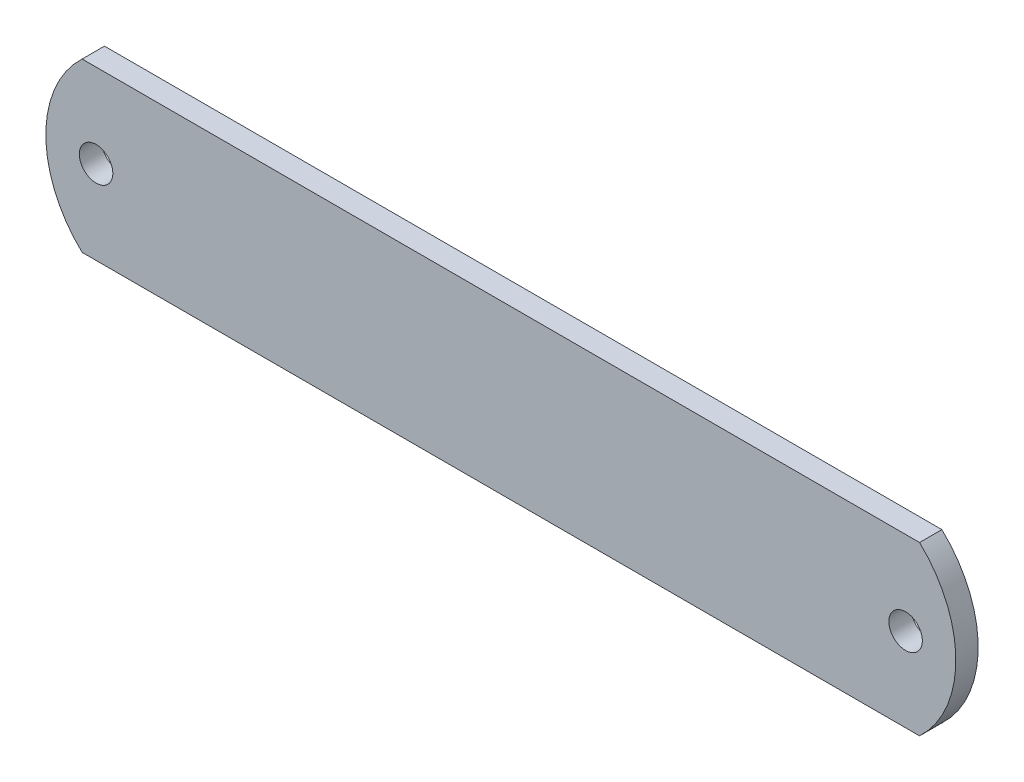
from build123d import *

# Parameters (mm, degrees)
SKETCH_1_R      = 3
EXTRUDE_1_DEPTH = 4


with BuildPart() as part:
    # Sketch 1 → Extrude 1 (new body)
    with BuildSketch(Plane.XY):
        with BuildLine():
            Line((6.5, 30), (156.5, 30))
            ThreePointArc((156.5, 30), (163, 15), (156.5, 0))
            Line((156.5, 0), (6.5, 0))
            ThreePointArc((6.5, 0), (0, 15), (6.5, 30))
        make_face()
        with Locations((9, 15)):
            Circle(SKETCH_1_R, mode=Mode.SUBTRACT)
        with Locations(Location((154, 15, 0), (0, 0, 180))):
            Circle(SKETCH_1_R, mode=Mode.SUBTRACT)
    extrude(amount=EXTRUDE_1_DEPTH)


solid = part.part
